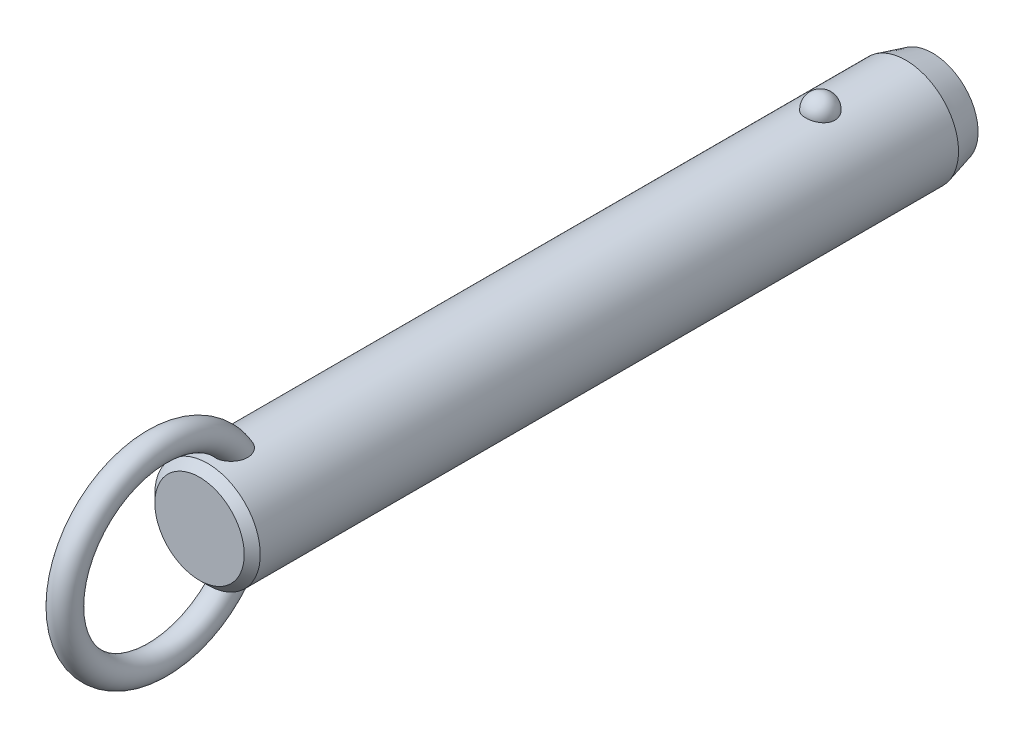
ISO-10303-21;
HEADER;
FILE_DESCRIPTION(('STEP AP214'),'2;1');
FILE_NAME('part.step','',(''),(''),'','','');
FILE_SCHEMA(('AUTOMOTIVE_DESIGN { 1 0 10303 214 1 1 1 1 }'));
ENDSEC;
DATA;
#1=APPLICATION_CONTEXT('core data for automotive mechanical design processes');
#2=APPLICATION_PROTOCOL_DEFINITION('international standard','automotive_design',2000,#1);
#3=PRODUCT_CONTEXT('',#1,'mechanical');
#4=PRODUCT('Part','Part','',(#3));
#5=PRODUCT_RELATED_PRODUCT_CATEGORY('part','',(#4));
#6=PRODUCT_DEFINITION_FORMATION('','',#4);
#7=PRODUCT_DEFINITION_CONTEXT('part definition',#1,'design');
#8=PRODUCT_DEFINITION('design','',#6,#7);
#9=PRODUCT_DEFINITION_SHAPE('','',#8);
#10=(LENGTH_UNIT() NAMED_UNIT(*) SI_UNIT(.MILLI.,.METRE.));
#11=(NAMED_UNIT(*) PLANE_ANGLE_UNIT() SI_UNIT($,.RADIAN.));
#12=(NAMED_UNIT(*) SI_UNIT($,.STERADIAN.) SOLID_ANGLE_UNIT());
#13=UNCERTAINTY_MEASURE_WITH_UNIT(LENGTH_MEASURE(1.E-05),#10,'distance_accuracy_value','');
#14=(GEOMETRIC_REPRESENTATION_CONTEXT(3) GLOBAL_UNCERTAINTY_ASSIGNED_CONTEXT((#13)) GLOBAL_UNIT_ASSIGNED_CONTEXT((#10,
#11,#12)) REPRESENTATION_CONTEXT('',''));
#15=CARTESIAN_POINT('',(0.,0.,0.));
#16=DIRECTION('',(0.,0.,1.));
#17=DIRECTION('',(1.,0.,0.));
#18=AXIS2_PLACEMENT_3D('',#15,#16,#17);
#19=CARTESIAN_POINT('',(0.,0.,81.3));
#20=DIRECTION('',(0.,0.,-1.));
#21=DIRECTION('',(-1.,0.,0.));
#22=AXIS2_PLACEMENT_3D('',#19,#20,#21);
#23=CYLINDRICAL_SURFACE('',#22,7.9);
#24=CARTESIAN_POINT('',(2.1785689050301,7.59367088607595,-2.19999999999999));
#25=CARTESIAN_POINT('',(2.17856679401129,7.59367269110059,-2.07701843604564));
#26=CARTESIAN_POINT('',(2.16853481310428,7.59657145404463,-1.95401006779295));
#27=CARTESIAN_POINT('',(2.12864689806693,7.607843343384,-1.71147811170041));
#28=CARTESIAN_POINT('',(2.09878338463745,7.61621856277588,-1.59195587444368));
#29=CARTESIAN_POINT('',(2.0199931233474,7.63749180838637,-1.3598563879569));
#30=CARTESIAN_POINT('',(1.97107475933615,7.6503878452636,-1.24727610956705));
#31=CARTESIAN_POINT('',(1.85539377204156,7.67926115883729,-1.03213234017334));
#32=CARTESIAN_POINT('',(1.78863158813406,7.69523835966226,-0.929568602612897));
#33=CARTESIAN_POINT('',(1.63856494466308,7.7285848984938,-0.736786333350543));
#34=CARTESIAN_POINT('',(1.55518140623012,7.7459606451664,-0.646630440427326));
#35=CARTESIAN_POINT('',(1.37422937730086,7.78009978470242,-0.481747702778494));
#36=CARTESIAN_POINT('',(1.27666086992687,7.79686317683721,-0.407020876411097));
#37=CARTESIAN_POINT('',(1.07024728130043,7.82786153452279,-0.275278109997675));
#38=CARTESIAN_POINT('',(0.961434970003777,7.84210353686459,-0.218212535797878));
#39=CARTESIAN_POINT('',(0.735351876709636,7.86652194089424,-0.123146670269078));
#40=CARTESIAN_POINT('',(0.618082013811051,7.87669878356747,-0.085144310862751));
#41=CARTESIAN_POINT('',(0.380637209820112,7.89170521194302,-0.0298158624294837));
#42=CARTESIAN_POINT('',(0.260550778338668,7.89662650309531,-0.0121347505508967));
#43=CARTESIAN_POINT('',(0.0190117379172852,7.90090003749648,0.00324379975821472));
#44=CARTESIAN_POINT('',(-0.102440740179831,7.90025280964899,0.00094313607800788));
#45=CARTESIAN_POINT('',(-0.341452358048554,7.89351056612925,-0.0233955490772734));
#46=CARTESIAN_POINT('',(-0.459042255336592,7.88749257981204,-0.0451545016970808));
#47=CARTESIAN_POINT('',(-0.688796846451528,7.87075812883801,-0.107408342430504));
#48=CARTESIAN_POINT('',(-0.800961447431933,7.86004158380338,-0.147903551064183));
#49=CARTESIAN_POINT('',(-1.01743634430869,7.83497131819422,-0.246799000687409));
#50=CARTESIAN_POINT('',(-1.12169791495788,7.82059709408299,-0.305300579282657));
#51=CARTESIAN_POINT('',(-1.31891765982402,7.78976470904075,-0.438549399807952));
#52=CARTESIAN_POINT('',(-1.41187469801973,7.77330633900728,-0.513298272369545));
#53=CARTESIAN_POINT('',(-1.58577142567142,7.73972434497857,-0.678622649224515));
#54=CARTESIAN_POINT('',(-1.66645140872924,7.72259402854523,-0.769470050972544));
#55=CARTESIAN_POINT('',(-1.81161503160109,7.68983776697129,-0.963538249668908));
#56=CARTESIAN_POINT('',(-1.87609753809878,7.6742119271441,-1.06675991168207));
#57=CARTESIAN_POINT('',(-1.98790138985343,7.6460202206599,-1.28401170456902));
#58=CARTESIAN_POINT('',(-2.03501994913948,7.63349104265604,-1.39815107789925));
#59=CARTESIAN_POINT('',(-2.10986724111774,7.6131449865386,-1.63301784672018));
#60=CARTESIAN_POINT('',(-2.1375965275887,7.60532797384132,-1.75374505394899));
#61=CARTESIAN_POINT('',(-2.17289256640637,7.5953195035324,-1.99782562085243));
#62=CARTESIAN_POINT('',(-2.18054294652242,7.59310471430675,-2.12116592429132));
#63=CARTESIAN_POINT('',(-2.17572919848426,7.59448538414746,-2.36741799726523));
#64=CARTESIAN_POINT('',(-2.1632656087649,7.59808068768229,-2.49032977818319));
#65=CARTESIAN_POINT('',(-2.11865035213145,7.61064035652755,-2.73161015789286));
#66=CARTESIAN_POINT('',(-2.08659579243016,7.61957823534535,-2.84999812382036));
#67=CARTESIAN_POINT('',(-2.00367799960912,7.64179982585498,-3.07955956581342));
#68=CARTESIAN_POINT('',(-1.9528140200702,7.65508371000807,-3.19073275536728));
#69=CARTESIAN_POINT('',(-1.83321113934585,7.68460381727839,-3.40337899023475));
#70=CARTESIAN_POINT('',(-1.76437735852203,7.70085556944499,-3.50479651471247));
#71=CARTESIAN_POINT('',(-1.61069526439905,7.73445734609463,-3.69446912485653));
#72=CARTESIAN_POINT('',(-1.52584634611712,7.75180741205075,-3.78272371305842));
#73=CARTESIAN_POINT('',(-1.34198059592,7.78574608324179,-3.94393987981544));
#74=CARTESIAN_POINT('',(-1.24291308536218,7.80233167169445,-4.01684434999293));
#75=CARTESIAN_POINT('',(-1.03352039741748,7.83281625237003,-4.14489386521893));
#76=CARTESIAN_POINT('',(-0.92319600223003,7.84671543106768,-4.20004014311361));
#77=CARTESIAN_POINT('',(-0.695822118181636,7.87011575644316,-4.29042017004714));
#78=CARTESIAN_POINT('',(-0.578872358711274,7.87966903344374,-4.32589112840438));
#79=CARTESIAN_POINT('',(-0.340410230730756,7.8935652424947,-4.37692226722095));
#80=CARTESIAN_POINT('',(-0.218898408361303,7.89790879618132,-4.39248482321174));
#81=CARTESIAN_POINT('',(0.0228107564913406,7.90087453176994,-4.40314405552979));
#82=CARTESIAN_POINT('',(0.142990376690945,7.89960185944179,-4.39861683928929));
#83=CARTESIAN_POINT('',(0.380829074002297,7.89171262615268,-4.37008293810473));
#84=CARTESIAN_POINT('',(0.498488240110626,7.8850962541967,-4.34607694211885));
#85=CARTESIAN_POINT('',(0.727535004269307,7.86726442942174,-4.27939317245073));
#86=CARTESIAN_POINT('',(0.838944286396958,7.85606616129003,-4.236785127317));
#87=CARTESIAN_POINT('',(1.05295421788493,7.83025654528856,-4.13408348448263));
#88=CARTESIAN_POINT('',(1.15555431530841,7.81564498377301,-4.07398879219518));
#89=CARTESIAN_POINT('',(1.35076763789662,7.7843022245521,-3.93687432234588));
#90=CARTESIAN_POINT('',(1.4432046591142,7.76754209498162,-3.85961036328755));
#91=CARTESIAN_POINT('',(1.6139111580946,7.73387857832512,-3.69076949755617));
#92=CARTESIAN_POINT('',(1.6921781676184,7.71697516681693,-3.59919010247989));
#93=CARTESIAN_POINT('',(1.83380875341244,7.6845643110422,-3.40247278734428));
#94=CARTESIAN_POINT('',(1.89689280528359,7.66908588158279,-3.29712873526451));
#95=CARTESIAN_POINT('',(2.0047823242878,7.64159441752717,-3.07707931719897));
#96=CARTESIAN_POINT('',(2.0495945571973,7.62958010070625,-2.96237743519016));
#97=CARTESIAN_POINT('',(2.11580183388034,7.61146617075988,-2.74040519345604));
#98=CARTESIAN_POINT('',(2.13929812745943,7.60484503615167,-2.63379846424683));
#99=CARTESIAN_POINT('',(2.17068242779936,7.59594664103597,-2.41813481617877));
#100=CARTESIAN_POINT('',(2.17857077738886,7.59366928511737,-2.30907795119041));
#101=CARTESIAN_POINT('',(2.1785689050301,7.59367088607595,-2.19999999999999));
#102=B_SPLINE_CURVE_WITH_KNOTS('',3,(#24,#25,#26,#27,#28,#29,#30,#31,#32,#33,#34,#35,#36,#37,
#38,#39,#40,#41,#42,#43,#44,#45,#46,#47,#48,#49,#50,#51,#52,#53,#54,#55,#56,#57,#58,#59,#60,#61,
#62,#63,#64,#65,#66,#67,#68,#69,#70,#71,#72,#73,#74,#75,#76,#77,#78,#79,#80,#81,#82,#83,#84,#85,
#86,#87,#88,#89,#90,#91,#92,#93,#94,#95,#96,#97,#98,#99,#100,#101),.UNSPECIFIED.,.T.,.F.,(4,2,2,
2,2,2,2,2,2,2,2,2,2,2,2,2,2,2,2,2,2,2,2,2,2,2,2,2,2,2,2,2,2,2,2,2,2,2,4),(0.,0.368552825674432,
0.737246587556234,1.10577831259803,1.4743009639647,1.8446206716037,2.21494081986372,
2.5842105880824,2.95344028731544,3.31611630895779,3.67875788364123,4.03628044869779,
4.39380913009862,4.75338791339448,5.11300280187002,5.47939989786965,5.8458226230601,
6.21639834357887,6.58696347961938,6.95598276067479,7.32499216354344,7.69218715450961,
8.0593967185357,8.42858578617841,8.79778880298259,9.16834203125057,9.5388695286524,
9.90482699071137,10.2707407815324,10.6298333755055,10.9889132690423,11.3466585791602,
11.7044262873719,12.0676511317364,12.4309391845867,12.8004764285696,13.1698767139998,
13.4967701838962,13.8236564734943),.UNSPECIFIED.);
#103=CARTESIAN_POINT('',(2.1785689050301,7.59367088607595,-2.19999999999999));
#104=VERTEX_POINT('',#103);
#105=EDGE_CURVE('E41',#104,#104,#102,.T.);
#106=ORIENTED_EDGE('',*,*,#105,.T.);
#107=EDGE_LOOP('',(#106));
#108=FACE_BOUND('',#107,.T.);
#109=CARTESIAN_POINT('',(0.,0.,89.62));
#110=DIRECTION('',(0.,0.,1.));
#111=DIRECTION('',(1.,0.,0.));
#112=AXIS2_PLACEMENT_3D('',#109,#110,#111);
#113=CIRCLE('',#112,7.9);
#114=CARTESIAN_POINT('',(-7.90000000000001,0.,89.62));
#115=VERTEX_POINT('',#114);
#116=EDGE_CURVE('E10',#115,#115,#113,.F.);
#117=ORIENTED_EDGE('',*,*,#116,.T.);
#118=EDGE_LOOP('',(#117));
#119=FACE_BOUND('',#118,.T.);
#120=CARTESIAN_POINT('',(-0.630969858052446,-7.87476203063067,83.5124322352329));
#121=CARTESIAN_POINT('',(-0.734180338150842,-7.8664899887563,83.547285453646));
#122=CARTESIAN_POINT('',(-0.834476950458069,-7.85639291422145,83.5908160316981));
#123=CARTESIAN_POINT('',(-1.0262035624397,-7.83366343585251,83.694094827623));
#124=CARTESIAN_POINT('',(-1.1176141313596,-7.82102565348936,83.7538775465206));
#125=CARTESIAN_POINT('',(-1.28877277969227,-7.79464922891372,83.8878390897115));
#126=CARTESIAN_POINT('',(-1.36854014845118,-7.78091246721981,83.961993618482));
#127=CARTESIAN_POINT('',(-1.5146152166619,-7.75380398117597,84.1224941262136));
#128=CARTESIAN_POINT('',(-1.58092966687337,-7.74043207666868,84.2088339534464));
#129=CARTESIAN_POINT('',(-1.70019064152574,-7.71512522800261,84.3929784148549));
#130=CARTESIAN_POINT('',(-1.75284037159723,-7.70322473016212,84.4909792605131));
#131=CARTESIAN_POINT('',(-1.84263464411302,-7.68224112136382,84.6941029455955));
#132=CARTESIAN_POINT('',(-1.87977299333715,-7.6731591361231,84.7992286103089));
#133=CARTESIAN_POINT('',(-1.94152728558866,-7.65777930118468,85.0232849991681));
#134=CARTESIAN_POINT('',(-1.96475471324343,-7.65179654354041,85.1426167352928));
#135=CARTESIAN_POINT('',(-1.99449499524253,-7.64409642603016,85.3834298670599));
#136=CARTESIAN_POINT('',(-2.0010005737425,-7.64238092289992,85.5049121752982));
#137=CARTESIAN_POINT('',(-1.99856014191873,-7.64302120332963,85.7683409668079));
#138=CARTESIAN_POINT('',(-1.98680021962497,-7.64611845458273,85.9102565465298));
#139=CARTESIAN_POINT('',(-1.94457772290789,-7.65696186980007,86.1911188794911));
#140=CARTESIAN_POINT('',(-1.91409393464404,-7.66471330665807,86.3300620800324));
#141=CARTESIAN_POINT('',(-1.82768670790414,-7.68582947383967,86.631939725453));
#142=CARTESIAN_POINT('',(-1.76772963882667,-7.70003779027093,86.793686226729));
#143=CARTESIAN_POINT('',(-1.65998501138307,-7.72371550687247,87.0276956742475));
#144=CARTESIAN_POINT('',(-1.621079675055,-7.73200670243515,87.1042974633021));
#145=CARTESIAN_POINT('',(-1.53727726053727,-7.74910377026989,87.2540798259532));
#146=CARTESIAN_POINT('',(-1.49238215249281,-7.75790947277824,87.3272615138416));
#147=CARTESIAN_POINT('',(-1.3739705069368,-7.77993338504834,87.5028838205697));
#148=CARTESIAN_POINT('',(-1.29690364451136,-7.79328473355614,87.6029557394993));
#149=CARTESIAN_POINT('',(-1.12885487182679,-7.81939266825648,87.7907147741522));
#150=CARTESIAN_POINT('',(-1.03789926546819,-7.83215032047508,87.8784247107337));
#151=CARTESIAN_POINT('',(-0.869532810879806,-7.85231710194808,88.0134148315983));
#152=CARTESIAN_POINT('',(-0.795716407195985,-7.86021093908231,88.065076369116));
#153=CARTESIAN_POINT('',(-0.64081313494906,-7.87434920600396,88.1563815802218));
#154=CARTESIAN_POINT('',(-0.55973779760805,-7.88059619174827,88.1960438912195));
#155=CARTESIAN_POINT('',(-0.406456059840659,-7.88984116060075,88.2543008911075));
#156=CARTESIAN_POINT('',(-0.335227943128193,-7.89321892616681,88.2753848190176));
#157=CARTESIAN_POINT('',(-0.190193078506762,-7.89804235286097,88.3054141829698));
#158=CARTESIAN_POINT('',(-0.116388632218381,-7.89948969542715,88.3143701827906));
#159=CARTESIAN_POINT('',(0.0318414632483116,-7.90028409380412,88.3192915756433));
#160=CARTESIAN_POINT('',(0.10626813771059,-7.89962640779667,88.3152276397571));
#161=CARTESIAN_POINT('',(0.253290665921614,-7.8962818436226,88.2944615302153));
#162=CARTESIAN_POINT('',(0.32588518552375,-7.8935935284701,88.2777504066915));
#163=CARTESIAN_POINT('',(0.481441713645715,-7.88577340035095,88.2287380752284));
#164=CARTESIAN_POINT('',(0.563611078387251,-7.88026321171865,88.194005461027));
#165=CARTESIAN_POINT('',(0.721129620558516,-7.86741729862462,88.1117965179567));
#166=CARTESIAN_POINT('',(0.796466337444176,-7.86007832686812,88.0642975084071));
#167=CARTESIAN_POINT('',(0.971456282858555,-7.84073285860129,87.936513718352));
#168=CARTESIAN_POINT('',(1.06719686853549,-7.82809461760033,87.8510047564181));
#169=CARTESIAN_POINT('',(1.24418921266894,-7.80192439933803,87.666232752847));
#170=CARTESIAN_POINT('',(1.32540832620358,-7.78839049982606,87.5669395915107));
#171=CARTESIAN_POINT('',(1.45199971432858,-7.76559693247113,87.3895760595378));
#172=CARTESIAN_POINT('',(1.50085649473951,-7.75626094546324,87.3139542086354));
#173=CARTESIAN_POINT('',(1.59197749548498,-7.7380727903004,87.1587428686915));
#174=CARTESIAN_POINT('',(1.63423919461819,-7.72922080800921,87.0791518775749));
#175=CARTESIAN_POINT('',(1.71222612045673,-7.71231959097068,86.9166640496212));
#176=CARTESIAN_POINT('',(1.74794516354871,-7.70427111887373,86.8337641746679));
#177=CARTESIAN_POINT('',(1.81270113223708,-7.68929240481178,86.6652967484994));
#178=CARTESIAN_POINT('',(1.84173789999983,-7.68236218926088,86.5797291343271));
#179=CARTESIAN_POINT('',(1.89322698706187,-7.66983757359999,86.4052870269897));
#180=CARTESIAN_POINT('',(1.91558744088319,-7.66426199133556,86.3163838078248));
#181=CARTESIAN_POINT('',(1.95281367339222,-7.65485915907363,86.1369696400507));
#182=CARTESIAN_POINT('',(1.96767946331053,-7.65103190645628,86.0464586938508));
#183=CARTESIAN_POINT('',(2.00021456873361,-7.64262981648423,85.7737320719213));
#184=CARTESIAN_POINT('',(2.00600691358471,-7.6410871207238,85.5897099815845));
#185=CARTESIAN_POINT('',(1.98445334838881,-7.64669564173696,85.2765019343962));
#186=CARTESIAN_POINT('',(1.96607186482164,-7.65149688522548,85.146618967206));
#187=CARTESIAN_POINT('',(1.90884967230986,-7.6659762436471,84.8916321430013));
#188=CARTESIAN_POINT('',(1.8700210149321,-7.67565148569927,84.766525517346));
#189=CARTESIAN_POINT('',(1.77063986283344,-7.69918471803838,84.5245401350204));
#190=CARTESIAN_POINT('',(1.70993724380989,-7.71307150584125,84.4077250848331));
#191=CARTESIAN_POINT('',(1.5673307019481,-7.74330306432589,84.1881444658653));
#192=CARTESIAN_POINT('',(1.48543692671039,-7.75964665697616,84.0853722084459));
#193=CARTESIAN_POINT('',(1.31346177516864,-7.79047523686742,83.9093800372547));
#194=CARTESIAN_POINT('',(1.22547278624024,-7.80495298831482,83.8341066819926));
#195=CARTESIAN_POINT('',(1.03724352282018,-7.83218597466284,83.7004864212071));
#196=CARTESIAN_POINT('',(0.937008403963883,-7.84494192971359,83.6421324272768));
#197=CARTESIAN_POINT('',(0.733599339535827,-7.86649045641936,83.5470270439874));
#198=CARTESIAN_POINT('',(0.630941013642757,-7.87547134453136,83.5092109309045));
#199=CARTESIAN_POINT('',(0.420465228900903,-7.88950708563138,83.4511160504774));
#200=CARTESIAN_POINT('',(0.312645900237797,-7.89456050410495,83.4308436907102));
#201=CARTESIAN_POINT('',(0.0960869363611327,-7.9001518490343,83.4084559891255));
#202=CARTESIAN_POINT('',(-0.0126341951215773,-7.90073226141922,83.4061698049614));
#203=CARTESIAN_POINT('',(-0.228766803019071,-7.89742350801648,83.4193678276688));
#204=CARTESIAN_POINT('',(-0.336180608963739,-7.89354403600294,83.4348134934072));
#205=CARTESIAN_POINT('',(-0.473410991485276,-7.88586871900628,83.4662177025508));
#206=CARTESIAN_POINT('',(-0.50525779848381,-7.88388984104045,83.4743541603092));
#207=CARTESIAN_POINT('',(-0.5684812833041,-7.87958326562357,83.4922083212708));
#208=CARTESIAN_POINT('',(-0.599857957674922,-7.87725556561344,83.5019260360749));
#209=CARTESIAN_POINT('',(-0.630969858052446,-7.87476203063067,83.5124322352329));
#210=B_SPLINE_CURVE_WITH_KNOTS('',3,(#120,#121,#122,#123,#124,#125,#126,#127,#128,#129,#130,
#131,#132,#133,#134,#135,#136,#137,#138,#139,#140,#141,#142,#143,#144,#145,#146,#147,#148,#149,
#150,#151,#152,#153,#154,#155,#156,#157,#158,#159,#160,#161,#162,#163,#164,#165,#166,#167,#168,
#169,#170,#171,#172,#173,#174,#175,#176,#177,#178,#179,#180,#181,#182,#183,#184,#185,#186,#187,
#188,#189,#190,#191,#192,#193,#194,#195,#196,#197,#198,#199,#200,#201,#202,#203,#204,#205,#206,
#207,#208,#209),.UNSPECIFIED.,.T.,.F.,(4,2,2,2,2,2,2,2,2,2,2,2,2,2,2,2,2,2,2,2,2,2,2,2,2,2,2,2,
2,2,2,2,2,2,2,2,2,2,2,2,2,2,2,2,4),(0.,0.327622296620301,0.655945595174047,0.983718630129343,
1.3113267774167,1.64554655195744,1.9798996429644,2.34365728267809,2.70757317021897,
3.13333684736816,3.55958380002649,4.07655306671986,4.3352789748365,4.59391999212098,
4.9738243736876,5.35301797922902,5.62348245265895,5.89352465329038,6.11565959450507,
6.33760092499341,6.56004255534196,6.78264174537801,7.04930844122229,7.31645206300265,
7.70130871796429,8.08701995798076,8.3582450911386,8.62957365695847,8.90115735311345,
9.17274746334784,9.44791855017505,9.72308922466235,10.2715298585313,10.6638393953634,
11.0559179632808,11.4507403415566,11.845374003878,12.1936425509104,12.5417649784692,
12.8695063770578,13.1973674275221,13.5221104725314,13.8461490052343,13.9449071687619,
14.0436660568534),.UNSPECIFIED.);
#211=CARTESIAN_POINT('',(-0.630969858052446,-7.87476203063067,83.5124322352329));
#212=VERTEX_POINT('',#211);
#213=EDGE_CURVE('E59',#212,#212,#210,.T.);
#214=ORIENTED_EDGE('',*,*,#213,.T.);
#215=EDGE_LOOP('',(#214));
#216=FACE_BOUND('',#215,.T.);
#217=CARTESIAN_POINT('',(-0.630969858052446,7.87476203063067,83.5124322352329));
#218=CARTESIAN_POINT('',(-0.52891882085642,7.88293636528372,83.4779798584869));
#219=CARTESIAN_POINT('',(-0.423745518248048,7.8893481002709,83.451915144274));
#220=CARTESIAN_POINT('',(-0.210236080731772,7.8979273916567,83.4172825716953));
#221=CARTESIAN_POINT('',(-0.10189380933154,7.90008607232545,83.4087513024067));
#222=CARTESIAN_POINT('',(0.114660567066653,7.89990877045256,83.4094570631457));
#223=CARTESIAN_POINT('',(0.222872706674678,7.89757640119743,83.4186798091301));
#224=CARTESIAN_POINT('',(0.436107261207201,7.88867538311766,83.4546525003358));
#225=CARTESIAN_POINT('',(0.541131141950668,7.8821087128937,83.4813942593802));
#226=CARTESIAN_POINT('',(0.745085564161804,7.86545130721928,83.5517561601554));
#227=CARTESIAN_POINT('',(0.844015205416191,7.85536005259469,83.5953787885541));
#228=CARTESIAN_POINT('',(1.03299167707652,7.83275153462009,83.6983796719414));
#229=CARTESIAN_POINT('',(1.12303841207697,7.8202342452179,83.7577580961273));
#230=CARTESIAN_POINT('',(1.29214734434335,7.79408219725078,83.8908647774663));
#231=CARTESIAN_POINT('',(1.37116907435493,7.78044359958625,83.9646436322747));
#232=CARTESIAN_POINT('',(1.51597677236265,7.75353170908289,84.1242353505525));
#233=CARTESIAN_POINT('',(1.58176261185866,7.74025841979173,84.2100483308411));
#234=CARTESIAN_POINT('',(1.70057386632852,7.71504069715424,84.393644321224));
#235=CARTESIAN_POINT('',(1.75320073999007,7.7031425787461,84.4916906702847));
#236=CARTESIAN_POINT('',(1.8429376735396,7.68216822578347,84.6948931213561));
#237=CARTESIAN_POINT('',(1.88004278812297,7.67309289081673,84.8000514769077));
#238=CARTESIAN_POINT('',(1.9417232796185,7.6577294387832,85.0241671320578));
#239=CARTESIAN_POINT('',(1.96491037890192,7.65175648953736,85.1435248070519));
#240=CARTESIAN_POINT('',(1.9945689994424,7.64407702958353,85.3843848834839));
#241=CARTESIAN_POINT('',(2.00103304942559,7.64237242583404,85.5058882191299));
#242=CARTESIAN_POINT('',(1.9985016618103,7.64303650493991,85.7693688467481));
#243=CARTESIAN_POINT('',(1.98669038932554,7.64614714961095,85.9113141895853));
#244=CARTESIAN_POINT('',(1.94436120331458,7.6570170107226,86.1922287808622));
#245=CARTESIAN_POINT('',(1.91382203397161,7.66478150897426,86.3311944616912));
#246=CARTESIAN_POINT('',(1.82728754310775,7.68592483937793,86.6331110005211));
#247=CARTESIAN_POINT('',(1.76725778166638,7.70014685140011,86.794872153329));
#248=CARTESIAN_POINT('',(1.65939700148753,7.72384204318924,87.0288914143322));
#249=CARTESIAN_POINT('',(1.62045187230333,7.73213852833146,87.1054942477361));
#250=CARTESIAN_POINT('',(1.5365668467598,7.74924489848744,87.2552737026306));
#251=CARTESIAN_POINT('',(1.49162892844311,7.75805461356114,87.3284514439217));
#252=CARTESIAN_POINT('',(1.37317698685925,7.78007342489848,87.5039520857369));
#253=CARTESIAN_POINT('',(1.29612360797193,7.79341423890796,87.6039112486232));
#254=CARTESIAN_POINT('',(1.12812043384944,7.81949839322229,87.7914508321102));
#255=CARTESIAN_POINT('',(1.03719688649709,7.83224280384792,87.8790540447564));
#256=CARTESIAN_POINT('',(0.868871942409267,7.85239026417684,88.0138971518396));
#257=CARTESIAN_POINT('',(0.795056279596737,7.86027769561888,88.0655113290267));
#258=CARTESIAN_POINT('',(0.640160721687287,7.87440222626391,88.1567201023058));
#259=CARTESIAN_POINT('',(0.559092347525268,7.88064188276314,88.1963333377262));
#260=CARTESIAN_POINT('',(0.405820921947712,7.8898738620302,88.2545056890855));
#261=CARTESIAN_POINT('',(0.33459413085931,7.89324577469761,88.2755523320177));
#262=CARTESIAN_POINT('',(0.189568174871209,7.89805733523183,88.3055070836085));
#263=CARTESIAN_POINT('',(0.115771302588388,7.89949866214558,88.3144257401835));
#264=CARTESIAN_POINT('',(-0.032435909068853,7.90028156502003,88.3192758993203));
#265=CARTESIAN_POINT('',(-0.106847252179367,7.89961843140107,88.3151782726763));
#266=CARTESIAN_POINT('',(-0.253834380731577,7.8962642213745,88.2943519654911));
#267=CARTESIAN_POINT('',(-0.326408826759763,7.89357170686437,88.2776143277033));
#268=CARTESIAN_POINT('',(-0.481962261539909,7.88574179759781,88.2285391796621));
#269=CARTESIAN_POINT('',(-0.564145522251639,7.88022507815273,88.1937638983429));
#270=CARTESIAN_POINT('',(-0.721685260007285,7.8673664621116,88.1114686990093));
#271=CARTESIAN_POINT('',(-0.797029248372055,7.8600213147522,88.0639260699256));
#272=CARTESIAN_POINT('',(-0.972044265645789,7.84066026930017,87.9360267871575));
#273=CARTESIAN_POINT('',(-1.06779803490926,7.82801274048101,87.8504436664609));
#274=CARTESIAN_POINT('',(-1.24480531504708,7.80182621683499,87.6655223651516));
#275=CARTESIAN_POINT('',(-1.32602618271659,7.78828530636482,87.5661540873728));
#276=CARTESIAN_POINT('',(-1.45259834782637,7.76548487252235,87.3886806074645));
#277=CARTESIAN_POINT('',(-1.50143856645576,7.75614818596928,87.3130252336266));
#278=CARTESIAN_POINT('',(-1.59252410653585,7.73796020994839,87.1577484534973));
#279=CARTESIAN_POINT('',(-1.63476690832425,7.72910910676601,87.0781255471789));
#280=CARTESIAN_POINT('',(-1.71271318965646,7.71221133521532,86.9155750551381));
#281=CARTESIAN_POINT('',(-1.7484104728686,7.70416543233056,86.8326444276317));
#282=CARTESIAN_POINT('',(-1.81311929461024,7.6891937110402,86.6641168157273));
#283=CARTESIAN_POINT('',(-1.84213067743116,7.6822679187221,86.5785197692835));
#284=CARTESIAN_POINT('',(-1.89356259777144,7.66975461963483,86.4040254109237));
#285=CARTESIAN_POINT('',(-1.91589165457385,7.66418586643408,86.3150995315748));
#286=CARTESIAN_POINT('',(-1.95305070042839,7.65479859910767,86.1356424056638));
#287=CARTESIAN_POINT('',(-1.96788069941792,7.65098008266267,86.0451111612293));
#288=CARTESIAN_POINT('',(-2.00030078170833,7.64260704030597,85.7723270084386));
#289=CARTESIAN_POINT('',(-2.00600576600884,7.64108760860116,85.5882718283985));
#290=CARTESIAN_POINT('',(-1.98428483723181,7.64673945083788,85.2750800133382));
#291=CARTESIAN_POINT('',(-1.96583698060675,7.6515575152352,85.1452400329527));
#292=CARTESIAN_POINT('',(-1.90848948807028,7.66606613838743,84.8903619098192));
#293=CARTESIAN_POINT('',(-1.86960376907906,7.67575338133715,84.765320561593));
#294=CARTESIAN_POINT('',(-1.7701342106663,7.69930132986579,84.5235009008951));
#295=CARTESIAN_POINT('',(-1.70940488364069,7.71318991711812,84.4067844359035));
#296=CARTESIAN_POINT('',(-1.56672953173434,7.74342495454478,84.1873404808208));
#297=CARTESIAN_POINT('',(-1.48478316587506,7.75977144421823,84.0846132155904));
#298=CARTESIAN_POINT('',(-1.31266325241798,7.79061163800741,83.9086431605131));
#299=CARTESIAN_POINT('',(-1.22456383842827,7.80509908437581,83.8333589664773));
#300=CARTESIAN_POINT('',(-1.03622400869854,7.83231881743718,83.6998659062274));
#301=CARTESIAN_POINT('',(-0.936015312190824,7.84505551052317,83.6416137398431));
#302=CARTESIAN_POINT('',(-0.798824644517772,7.85957802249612,83.5775408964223));
#303=CARTESIAN_POINT('',(-0.765787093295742,7.86286821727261,83.5632248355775));
#304=CARTESIAN_POINT('',(-0.698939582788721,7.86909211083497,83.536436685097));
#305=CARTESIAN_POINT('',(-0.665129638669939,7.8720258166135,83.5239645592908));
#306=CARTESIAN_POINT('',(-0.630969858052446,7.87476203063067,83.5124322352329));
#307=B_SPLINE_CURVE_WITH_KNOTS('',3,(#217,#218,#219,#220,#221,#222,#223,#224,#225,#226,#227,
#228,#229,#230,#231,#232,#233,#234,#235,#236,#237,#238,#239,#240,#241,#242,#243,#244,#245,#246,
#247,#248,#249,#250,#251,#252,#253,#254,#255,#256,#257,#258,#259,#260,#261,#262,#263,#264,#265,
#266,#267,#268,#269,#270,#271,#272,#273,#274,#275,#276,#277,#278,#279,#280,#281,#282,#283,#284,
#285,#286,#287,#288,#289,#290,#291,#292,#293,#294,#295,#296,#297,#298,#299,#300,#301,#302,#303,
#304,#305,#306),.UNSPECIFIED.,.T.,.F.,(4,2,2,2,2,2,2,2,2,2,2,2,2,2,2,2,2,2,2,2,2,2,2,2,2,2,2,2,
2,2,2,2,2,2,2,2,2,2,2,2,2,2,2,2,4),(0.,0.323920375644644,0.648516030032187,0.97285063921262,
1.29703380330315,1.62126473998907,1.94549915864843,2.27089401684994,2.5962920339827,
2.93059633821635,3.26500707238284,3.62881644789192,3.99278833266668,4.41865421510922,
4.84500434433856,5.36209210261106,5.62087589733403,5.87957448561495,6.25918598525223,
6.63808782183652,6.90846748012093,7.17842501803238,7.40052350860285,7.62242871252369,
7.84483086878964,8.06739077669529,8.33414615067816,8.60137921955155,8.98641454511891,
9.3723041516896,9.6435867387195,9.91497268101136,10.1866142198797,10.4582620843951,
10.7334745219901,11.0086865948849,11.5572126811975,11.9494246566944,12.3413699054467,
12.7359755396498,13.1305875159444,13.4791770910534,13.82687259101,13.9353013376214,
14.0437279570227),.UNSPECIFIED.);
#308=CARTESIAN_POINT('',(-0.630969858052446,7.87476203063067,83.5124322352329));
#309=VERTEX_POINT('',#308);
#310=EDGE_CURVE('E67',#309,#309,#307,.T.);
#311=ORIENTED_EDGE('',*,*,#310,.T.);
#312=EDGE_LOOP('',(#311));
#313=FACE_BOUND('',#312,.T.);
#314=CARTESIAN_POINT('',(0.,0.,-14.9999999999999));
#315=DIRECTION('',(0.,0.,-1.));
#316=DIRECTION('',(-1.,0.,0.));
#317=AXIS2_PLACEMENT_3D('',#314,#315,#316);
#318=CIRCLE('',#317,7.9);
#319=CARTESIAN_POINT('',(-7.9,0.,-14.9999999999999));
#320=VERTEX_POINT('',#319);
#321=EDGE_CURVE('E56',#320,#320,#318,.F.);
#322=ORIENTED_EDGE('',*,*,#321,.T.);
#323=EDGE_LOOP('',(#322));
#324=FACE_BOUND('',#323,.T.);
#325=ADVANCED_FACE('F37',(#108,#119,#216,#313,#324),#23,.T.);
#326=CARTESIAN_POINT('',(0.,0.,-19.));
#327=DIRECTION('',(0.,0.,-1.));
#328=DIRECTION('',(-1.,0.,0.));
#329=AXIS2_PLACEMENT_3D('',#326,#327,#328);
#330=PLANE('',#329);
#331=CARTESIAN_POINT('',(0.,0.,-19.));
#332=DIRECTION('',(0.,0.,-1.));
#333=DIRECTION('',(-1.,0.,0.));
#334=AXIS2_PLACEMENT_3D('',#331,#332,#333);
#335=CIRCLE('',#334,6.82820323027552);
#336=CARTESIAN_POINT('',(-6.82820323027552,0.,-19.));
#337=VERTEX_POINT('',#336);
#338=EDGE_CURVE('E66',#337,#337,#335,.T.);
#339=ORIENTED_EDGE('',*,*,#338,.T.);
#340=EDGE_LOOP('',(#339));
#341=FACE_BOUND('',#340,.T.);
#342=ADVANCED_FACE('F85',(#341),#330,.T.);
#343=CARTESIAN_POINT('',(0.,0.,-19.));
#344=DIRECTION('',(0.,0.,1.));
#345=DIRECTION('',(1.,0.,0.));
#346=AXIS2_PLACEMENT_3D('',#343,#344,#345);
#347=CONICAL_SURFACE('',#346,6.82820323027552,0.261799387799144);
#348=ORIENTED_EDGE('',*,*,#321,.F.);
#349=EDGE_LOOP('',(#348));
#350=FACE_BOUND('',#349,.T.);
#351=ORIENTED_EDGE('',*,*,#338,.F.);
#352=EDGE_LOOP('',(#351));
#353=FACE_BOUND('',#352,.T.);
#354=ADVANCED_FACE('F83',(#350,#353),#347,.T.);
#355=CARTESIAN_POINT('',(0.,0.,90.82));
#356=DIRECTION('',(0.,0.,1.));
#357=DIRECTION('',(1.,0.,0.));
#358=AXIS2_PLACEMENT_3D('',#355,#356,#357);
#359=PLANE('',#358);
#360=CARTESIAN_POINT('',(0.,0.,90.82));
#361=DIRECTION('',(0.,0.,1.));
#362=DIRECTION('',(1.,0.,0.));
#363=AXIS2_PLACEMENT_3D('',#360,#361,#362);
#364=CIRCLE('',#363,6.69999999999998);
#365=CARTESIAN_POINT('',(-6.69999999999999,0.,90.82));
#366=VERTEX_POINT('',#365);
#367=EDGE_CURVE('E50',#366,#366,#364,.T.);
#368=ORIENTED_EDGE('',*,*,#367,.T.);
#369=EDGE_LOOP('',(#368));
#370=FACE_BOUND('',#369,.T.);
#371=ADVANCED_FACE('F77',(#370),#359,.T.);
#372=CARTESIAN_POINT('',(0.,0.,97.15));
#373=DIRECTION('',(1.,0.,0.));
#374=DIRECTION('',(0.,0.,-1.));
#375=AXIS2_PLACEMENT_3D('',#372,#373,#374);
#376=TOROIDAL_SURFACE('',#375,13.85,2.);
#377=ORIENTED_EDGE('',*,*,#310,.F.);
#378=EDGE_LOOP('',(#377));
#379=FACE_BOUND('',#378,.T.);
#380=ORIENTED_EDGE('',*,*,#213,.F.);
#381=EDGE_LOOP('',(#380));
#382=FACE_BOUND('',#381,.T.);
#383=ADVANCED_FACE('F73',(#379,#382),#376,.T.);
#384=CARTESIAN_POINT('',(0.,0.,90.82));
#385=DIRECTION('',(0.,0.,-1.));
#386=DIRECTION('',(-1.,0.,0.));
#387=AXIS2_PLACEMENT_3D('',#384,#385,#386);
#388=CONICAL_SURFACE('',#387,6.69999999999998,0.785398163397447);
#389=CARTESIAN_POINT('',(-7.90000000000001,0.,89.62));
#390=CARTESIAN_POINT('',(-7.88750000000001,0.,89.6325));
#391=CARTESIAN_POINT('',(-7.87500000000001,0.,89.645));
#392=CARTESIAN_POINT('',(-7.85000000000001,0.,89.67));
#393=CARTESIAN_POINT('',(-7.83750000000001,0.,89.6825));
#394=CARTESIAN_POINT('',(-7.81250000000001,0.,89.7075));
#395=CARTESIAN_POINT('',(-7.80000000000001,0.,89.72));
#396=CARTESIAN_POINT('',(-7.77500000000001,0.,89.745));
#397=CARTESIAN_POINT('',(-7.76250000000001,0.,89.7575));
#398=CARTESIAN_POINT('',(-7.73750000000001,0.,89.7825));
#399=CARTESIAN_POINT('',(-7.725,0.,89.795));
#400=CARTESIAN_POINT('',(-7.7,0.,89.82));
#401=CARTESIAN_POINT('',(-7.68750000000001,0.,89.8325));
#402=CARTESIAN_POINT('',(-7.66250000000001,0.,89.8575));
#403=CARTESIAN_POINT('',(-7.65000000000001,0.,89.87));
#404=CARTESIAN_POINT('',(-7.625,0.,89.895));
#405=CARTESIAN_POINT('',(-7.6125,0.,89.9075));
#406=CARTESIAN_POINT('',(-7.5875,0.,89.9325));
#407=CARTESIAN_POINT('',(-7.575,0.,89.945));
#408=CARTESIAN_POINT('',(-7.55,0.,89.97));
#409=CARTESIAN_POINT('',(-7.5375,0.,89.9825));
#410=CARTESIAN_POINT('',(-7.5125,0.,90.0075));
#411=CARTESIAN_POINT('',(-7.5,0.,90.02));
#412=CARTESIAN_POINT('',(-7.475,0.,90.045));
#413=CARTESIAN_POINT('',(-7.4625,0.,90.0575));
#414=CARTESIAN_POINT('',(-7.4375,0.,90.0825));
#415=CARTESIAN_POINT('',(-7.425,0.,90.095));
#416=CARTESIAN_POINT('',(-7.4,0.,90.12));
#417=CARTESIAN_POINT('',(-7.3875,0.,90.1325));
#418=CARTESIAN_POINT('',(-7.3625,0.,90.1575));
#419=CARTESIAN_POINT('',(-7.35,0.,90.17));
#420=CARTESIAN_POINT('',(-7.325,0.,90.195));
#421=CARTESIAN_POINT('',(-7.3125,0.,90.2075));
#422=CARTESIAN_POINT('',(-7.2875,0.,90.2325));
#423=CARTESIAN_POINT('',(-7.275,0.,90.245));
#424=CARTESIAN_POINT('',(-7.25,0.,90.27));
#425=CARTESIAN_POINT('',(-7.2375,0.,90.2825));
#426=CARTESIAN_POINT('',(-7.2125,0.,90.3075));
#427=CARTESIAN_POINT('',(-7.2,0.,90.32));
#428=CARTESIAN_POINT('',(-7.175,0.,90.345));
#429=CARTESIAN_POINT('',(-7.1625,0.,90.3575));
#430=CARTESIAN_POINT('',(-7.1375,0.,90.3825));
#431=CARTESIAN_POINT('',(-7.125,0.,90.395));
#432=CARTESIAN_POINT('',(-7.1,0.,90.42));
#433=CARTESIAN_POINT('',(-7.0875,0.,90.4325));
#434=CARTESIAN_POINT('',(-7.06249999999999,0.,90.4575));
#435=CARTESIAN_POINT('',(-7.04999999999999,0.,90.47));
#436=CARTESIAN_POINT('',(-7.02499999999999,0.,90.495));
#437=CARTESIAN_POINT('',(-7.0125,0.,90.5075));
#438=CARTESIAN_POINT('',(-6.9875,0.,90.5325));
#439=CARTESIAN_POINT('',(-6.975,0.,90.545));
#440=CARTESIAN_POINT('',(-6.94999999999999,0.,90.57));
#441=CARTESIAN_POINT('',(-6.93749999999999,0.,90.5825));
#442=CARTESIAN_POINT('',(-6.91249999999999,0.,90.6075));
#443=CARTESIAN_POINT('',(-6.9,0.,90.62));
#444=CARTESIAN_POINT('',(-6.87499999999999,0.,90.645));
#445=CARTESIAN_POINT('',(-6.86249999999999,0.,90.6575));
#446=CARTESIAN_POINT('',(-6.83749999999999,0.,90.6825));
#447=CARTESIAN_POINT('',(-6.82499999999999,0.,90.695));
#448=CARTESIAN_POINT('',(-6.79999999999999,0.,90.72));
#449=CARTESIAN_POINT('',(-6.78749999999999,0.,90.7325));
#450=CARTESIAN_POINT('',(-6.76249999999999,0.,90.7575));
#451=CARTESIAN_POINT('',(-6.74999999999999,0.,90.77));
#452=CARTESIAN_POINT('',(-6.72499999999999,0.,90.795));
#453=CARTESIAN_POINT('',(-6.71249999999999,0.,90.8075));
#454=CARTESIAN_POINT('',(-6.69999999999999,0.,90.82));
#455=B_SPLINE_CURVE_WITH_KNOTS('',3,(#389,#390,#391,#392,#393,#394,#395,#396,#397,#398,#399,
#400,#401,#402,#403,#404,#405,#406,#407,#408,#409,#410,#411,#412,#413,#414,#415,#416,#417,#418,
#419,#420,#421,#422,#423,#424,#425,#426,#427,#428,#429,#430,#431,#432,#433,#434,#435,#436,#437,
#438,#439,#440,#441,#442,#443,#444,#445,#446,#447,#448,#449,#450,#451,#452,#453,#454),
.UNSPECIFIED.,.F.,.F.,(4,2,2,2,2,2,2,2,2,2,2,2,2,2,2,2,2,2,2,2,2,2,2,2,2,2,2,2,2,2,2,2,4),(0.,
0.0530330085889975,0.106066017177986,0.159099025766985,0.212132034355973,0.265165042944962,
0.31819805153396,0.371231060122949,0.424264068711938,0.477297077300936,0.530330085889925,
0.583363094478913,0.636396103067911,0.6894291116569,0.742462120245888,0.795495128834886,
0.848528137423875,0.901561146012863,0.954594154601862,1.00762716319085,1.06066017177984,
1.11369318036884,1.16672618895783,1.21975919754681,1.27279220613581,1.3258252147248,
1.37885822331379,1.43189123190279,1.48492424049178,1.53795724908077,1.59099025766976,
1.64402326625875,1.69705627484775),.UNSPECIFIED.);
#456=EDGE_CURVE('BSEAM39',#115,#366,#455,.T.);
#457=ORIENTED_EDGE('',*,*,#116,.F.);
#458=ORIENTED_EDGE('',*,*,#367,.F.);
#459=ORIENTED_EDGE('',*,*,#456,.T.);
#460=ORIENTED_EDGE('',*,*,#456,.F.);
#461=EDGE_LOOP('',(#457,#459,#458,#460));
#462=FACE_BOUND('',#461,.T.);
#463=ADVANCED_FACE('F39',(#462),#388,.T.);
#464=CARTESIAN_POINT('',(0.,7.9,-2.19999999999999));
#465=DIRECTION('',(0.,1.,0.));
#466=DIRECTION('',(0.,0.,-1.));
#467=AXIS2_PLACEMENT_3D('',#464,#465,#466);
#468=SPHERICAL_SURFACE('',#467,2.2);
#469=ORIENTED_EDGE('',*,*,#105,.F.);
#470=EDGE_LOOP('',(#469));
#471=FACE_BOUND('',#470,.T.);
#472=ADVANCED_FACE('F79',(#471),#468,.T.);
#473=CLOSED_SHELL('',(#325,#342,#354,#371,#383,#463,#472));
#474=MANIFOLD_SOLID_BREP('B2',#473);
#475=ADVANCED_BREP_SHAPE_REPRESENTATION('',(#18,#474),#14);
#476=SHAPE_DEFINITION_REPRESENTATION(#9,#475);
ENDSEC;
END-ISO-10303-21;
